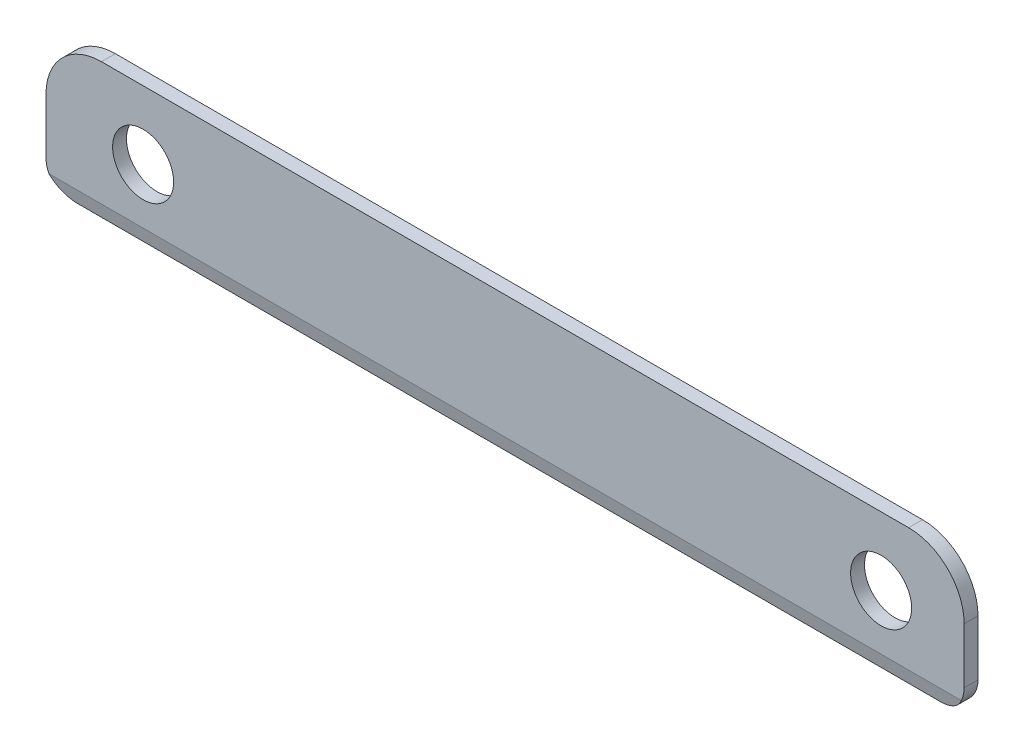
ISO-10303-21;
HEADER;
FILE_DESCRIPTION(('STEP AP214'),'2;1');
FILE_NAME('part.step','',(''),(''),'','','');
FILE_SCHEMA(('AUTOMOTIVE_DESIGN { 1 0 10303 214 1 1 1 1 }'));
ENDSEC;
DATA;
#1=APPLICATION_CONTEXT('core data for automotive mechanical design processes');
#2=APPLICATION_PROTOCOL_DEFINITION('international standard','automotive_design',2000,#1);
#3=PRODUCT_CONTEXT('',#1,'mechanical');
#4=PRODUCT('Part','Part','',(#3));
#5=PRODUCT_RELATED_PRODUCT_CATEGORY('part','',(#4));
#6=PRODUCT_DEFINITION_FORMATION('','',#4);
#7=PRODUCT_DEFINITION_CONTEXT('part definition',#1,'design');
#8=PRODUCT_DEFINITION('design','',#6,#7);
#9=PRODUCT_DEFINITION_SHAPE('','',#8);
#10=(LENGTH_UNIT() NAMED_UNIT(*) SI_UNIT(.MILLI.,.METRE.));
#11=(NAMED_UNIT(*) PLANE_ANGLE_UNIT() SI_UNIT($,.RADIAN.));
#12=(NAMED_UNIT(*) SI_UNIT($,.STERADIAN.) SOLID_ANGLE_UNIT());
#13=UNCERTAINTY_MEASURE_WITH_UNIT(LENGTH_MEASURE(1.E-05),#10,'distance_accuracy_value','');
#14=(GEOMETRIC_REPRESENTATION_CONTEXT(3) GLOBAL_UNCERTAINTY_ASSIGNED_CONTEXT((#13)) GLOBAL_UNIT_ASSIGNED_CONTEXT((#10,
#11,#12)) REPRESENTATION_CONTEXT('',''));
#15=CARTESIAN_POINT('',(0.,0.,0.));
#16=DIRECTION('',(0.,0.,1.));
#17=DIRECTION('',(1.,0.,0.));
#18=AXIS2_PLACEMENT_3D('',#15,#16,#17);
#19=CARTESIAN_POINT('',(145.845208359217,4.31677215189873,5.));
#20=DIRECTION('',(0.,0.,1.));
#21=DIRECTION('',(1.,0.,0.));
#22=AXIS2_PLACEMENT_3D('',#19,#20,#21);
#23=PLANE('',#22);
#24=DIRECTION('',(-1.,0.,0.));
#25=VECTOR('',#24,1.);
#26=CARTESIAN_POINT('',(165.845208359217,-20.1091288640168,4.99999999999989));
#27=LINE('',#26,#25);
#28=CARTESIAN_POINT('',(164.812448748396,-20.1091288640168,4.99999999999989));
#29=VERTEX_POINT('',#28);
#30=CARTESIAN_POINT('',(-164.04086295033,-20.1091288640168,4.99999999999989));
#31=VERTEX_POINT('',#30);
#32=EDGE_CURVE('E197',#29,#31,#27,.T.);
#33=ORIENTED_EDGE('',*,*,#32,.F.);
#34=CARTESIAN_POINT('',(155.845208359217,-15.6832278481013,5.));
#35=DIRECTION('',(0.,0.,1.));
#36=DIRECTION('',(-1.,0.,0.));
#37=AXIS2_PLACEMENT_3D('',#34,#35,#36);
#38=CIRCLE('',#37,10.);
#39=CARTESIAN_POINT('',(165.845208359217,-15.6832278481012,5.));
#40=VERTEX_POINT('',#39);
#41=EDGE_CURVE('E136',#29,#40,#38,.T.);
#42=ORIENTED_EDGE('',*,*,#41,.T.);
#43=DIRECTION('',(0.,1.,0.));
#44=VECTOR('',#43,1.);
#45=CARTESIAN_POINT('',(165.845208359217,-15.6832278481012,5.));
#46=LINE('',#45,#44);
#47=CARTESIAN_POINT('',(165.845208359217,4.31677215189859,5.));
#48=VERTEX_POINT('',#47);
#49=EDGE_CURVE('E56',#40,#48,#46,.T.);
#50=ORIENTED_EDGE('',*,*,#49,.T.);
#51=CARTESIAN_POINT('',(145.845208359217,4.31677215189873,5.));
#52=DIRECTION('',(0.,0.,1.));
#53=DIRECTION('',(1.,0.,0.));
#54=AXIS2_PLACEMENT_3D('',#51,#52,#53);
#55=CIRCLE('',#54,20.);
#56=CARTESIAN_POINT('',(145.845208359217,24.3167721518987,5.));
#57=VERTEX_POINT('',#56);
#58=EDGE_CURVE('E160',#48,#57,#55,.T.);
#59=ORIENTED_EDGE('',*,*,#58,.T.);
#60=DIRECTION('',(-1.,0.,0.));
#61=VECTOR('',#60,1.);
#62=CARTESIAN_POINT('',(-145.073622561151,24.3167721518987,5.));
#63=LINE('',#62,#61);
#64=CARTESIAN_POINT('',(-145.073622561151,24.3167721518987,5.));
#65=VERTEX_POINT('',#64);
#66=EDGE_CURVE('E98',#57,#65,#63,.T.);
#67=ORIENTED_EDGE('',*,*,#66,.T.);
#68=CARTESIAN_POINT('',(-145.073622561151,4.31677215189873,5.));
#69=DIRECTION('',(0.,0.,1.));
#70=DIRECTION('',(-1.,0.,0.));
#71=AXIS2_PLACEMENT_3D('',#68,#69,#70);
#72=CIRCLE('',#71,20.);
#73=CARTESIAN_POINT('',(-165.073622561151,4.31677215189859,5.));
#74=VERTEX_POINT('',#73);
#75=EDGE_CURVE('E116',#65,#74,#72,.T.);
#76=ORIENTED_EDGE('',*,*,#75,.T.);
#77=DIRECTION('',(0.,-1.,0.));
#78=VECTOR('',#77,1.);
#79=CARTESIAN_POINT('',(-165.073622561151,-15.6832278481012,5.));
#80=LINE('',#79,#78);
#81=CARTESIAN_POINT('',(-165.073622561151,-15.6832278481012,5.));
#82=VERTEX_POINT('',#81);
#83=EDGE_CURVE('E108',#74,#82,#80,.T.);
#84=ORIENTED_EDGE('',*,*,#83,.T.);
#85=CARTESIAN_POINT('',(-155.073622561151,-15.6832278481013,5.));
#86=DIRECTION('',(0.,0.,1.));
#87=DIRECTION('',(1.,0.,0.));
#88=AXIS2_PLACEMENT_3D('',#85,#86,#87);
#89=CIRCLE('',#88,10.);
#90=EDGE_CURVE('E114',#82,#31,#89,.T.);
#91=ORIENTED_EDGE('',*,*,#90,.T.);
#92=EDGE_LOOP('',(#33,#42,#50,#59,#67,#76,#84,#91));
#93=FACE_BOUND('',#92,.T.);
#94=CARTESIAN_POINT('',(-130.073622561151,-0.263085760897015,5.));
#95=DIRECTION('',(0.,0.,1.));
#96=DIRECTION('',(1.,0.,0.));
#97=AXIS2_PLACEMENT_3D('',#94,#95,#96);
#98=CIRCLE('',#97,11.);
#99=CARTESIAN_POINT('',(-119.073622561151,-0.263085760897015,5.));
#100=VERTEX_POINT('',#99);
#101=EDGE_CURVE('E147',#100,#100,#98,.T.);
#102=ORIENTED_EDGE('',*,*,#101,.F.);
#103=EDGE_LOOP('',(#102));
#104=FACE_BOUND('',#103,.T.);
#105=CARTESIAN_POINT('',(135.926377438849,-0.263085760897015,5.));
#106=DIRECTION('',(0.,0.,1.));
#107=DIRECTION('',(1.,0.,0.));
#108=AXIS2_PLACEMENT_3D('',#105,#106,#107);
#109=CIRCLE('',#108,11.);
#110=CARTESIAN_POINT('',(146.926377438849,-0.263085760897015,5.));
#111=VERTEX_POINT('',#110);
#112=EDGE_CURVE('E188',#111,#111,#109,.T.);
#113=ORIENTED_EDGE('',*,*,#112,.F.);
#114=EDGE_LOOP('',(#113));
#115=FACE_BOUND('',#114,.T.);
#116=ADVANCED_FACE('F33',(#93,#104,#115),#23,.T.);
#117=CARTESIAN_POINT('',(145.845208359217,4.31677215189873,0.));
#118=DIRECTION('',(0.,0.,1.));
#119=DIRECTION('',(1.,0.,0.));
#120=AXIS2_PLACEMENT_3D('',#117,#118,#119);
#121=PLANE('',#120);
#122=CARTESIAN_POINT('',(145.845208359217,4.31677215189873,0.));
#123=DIRECTION('',(0.,0.,1.));
#124=DIRECTION('',(1.,0.,0.));
#125=AXIS2_PLACEMENT_3D('',#122,#123,#124);
#126=CIRCLE('',#125,20.);
#127=CARTESIAN_POINT('',(165.845208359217,4.31677215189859,0.));
#128=VERTEX_POINT('',#127);
#129=CARTESIAN_POINT('',(145.845208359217,24.3167721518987,0.));
#130=VERTEX_POINT('',#129);
#131=EDGE_CURVE('E143',#128,#130,#126,.T.);
#132=ORIENTED_EDGE('',*,*,#131,.F.);
#133=DIRECTION('',(0.,1.,0.));
#134=VECTOR('',#133,1.);
#135=CARTESIAN_POINT('',(165.845208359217,-15.6832278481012,0.));
#136=LINE('',#135,#134);
#137=CARTESIAN_POINT('',(165.845208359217,-15.6832278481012,0.));
#138=VERTEX_POINT('',#137);
#139=EDGE_CURVE('E89',#138,#128,#136,.T.);
#140=ORIENTED_EDGE('',*,*,#139,.F.);
#141=CARTESIAN_POINT('',(155.845208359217,-15.6832278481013,0.));
#142=DIRECTION('',(0.,0.,1.));
#143=DIRECTION('',(-1.,0.,0.));
#144=AXIS2_PLACEMENT_3D('',#141,#142,#143);
#145=CIRCLE('',#144,10.);
#146=CARTESIAN_POINT('',(155.845208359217,-25.6832278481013,0.));
#147=VERTEX_POINT('',#146);
#148=EDGE_CURVE('E157',#147,#138,#145,.T.);
#149=ORIENTED_EDGE('',*,*,#148,.F.);
#150=DIRECTION('',(1.,0.,0.));
#151=VECTOR('',#150,1.);
#152=CARTESIAN_POINT('',(-155.073622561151,-25.6832278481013,0.));
#153=LINE('',#152,#151);
#154=CARTESIAN_POINT('',(-155.073622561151,-25.6832278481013,0.));
#155=VERTEX_POINT('',#154);
#156=EDGE_CURVE('E154',#155,#147,#153,.T.);
#157=ORIENTED_EDGE('',*,*,#156,.F.);
#158=CARTESIAN_POINT('',(-155.073622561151,-15.6832278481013,0.));
#159=DIRECTION('',(0.,0.,1.));
#160=DIRECTION('',(1.,0.,0.));
#161=AXIS2_PLACEMENT_3D('',#158,#159,#160);
#162=CIRCLE('',#161,10.);
#163=CARTESIAN_POINT('',(-165.073622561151,-15.6832278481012,0.));
#164=VERTEX_POINT('',#163);
#165=EDGE_CURVE('E152',#164,#155,#162,.T.);
#166=ORIENTED_EDGE('',*,*,#165,.F.);
#167=DIRECTION('',(0.,-1.,0.));
#168=VECTOR('',#167,1.);
#169=CARTESIAN_POINT('',(-165.073622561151,-15.6832278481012,0.));
#170=LINE('',#169,#168);
#171=CARTESIAN_POINT('',(-165.073622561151,4.31677215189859,0.));
#172=VERTEX_POINT('',#171);
#173=EDGE_CURVE('E125',#172,#164,#170,.T.);
#174=ORIENTED_EDGE('',*,*,#173,.F.);
#175=CARTESIAN_POINT('',(-145.073622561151,4.31677215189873,0.));
#176=DIRECTION('',(0.,0.,1.));
#177=DIRECTION('',(-1.,0.,0.));
#178=AXIS2_PLACEMENT_3D('',#175,#176,#177);
#179=CIRCLE('',#178,20.);
#180=CARTESIAN_POINT('',(-145.073622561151,24.3167721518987,0.));
#181=VERTEX_POINT('',#180);
#182=EDGE_CURVE('E149',#181,#172,#179,.T.);
#183=ORIENTED_EDGE('',*,*,#182,.F.);
#184=DIRECTION('',(-1.,0.,0.));
#185=VECTOR('',#184,1.);
#186=CARTESIAN_POINT('',(-145.073622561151,24.3167721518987,0.));
#187=LINE('',#186,#185);
#188=EDGE_CURVE('E146',#130,#181,#187,.T.);
#189=ORIENTED_EDGE('',*,*,#188,.F.);
#190=EDGE_LOOP('',(#132,#140,#149,#157,#166,#174,#183,#189));
#191=FACE_BOUND('',#190,.T.);
#192=CARTESIAN_POINT('',(-130.073622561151,-0.263085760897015,0.));
#193=DIRECTION('',(0.,0.,1.));
#194=DIRECTION('',(1.,0.,0.));
#195=AXIS2_PLACEMENT_3D('',#192,#193,#194);
#196=CIRCLE('',#195,11.);
#197=CARTESIAN_POINT('',(-119.073622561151,-0.263085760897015,0.));
#198=VERTEX_POINT('',#197);
#199=EDGE_CURVE('E185',#198,#198,#196,.T.);
#200=ORIENTED_EDGE('',*,*,#199,.T.);
#201=EDGE_LOOP('',(#200));
#202=FACE_BOUND('',#201,.T.);
#203=CARTESIAN_POINT('',(135.926377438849,-0.263085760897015,0.));
#204=DIRECTION('',(0.,0.,1.));
#205=DIRECTION('',(1.,0.,0.));
#206=AXIS2_PLACEMENT_3D('',#203,#204,#205);
#207=CIRCLE('',#206,11.);
#208=CARTESIAN_POINT('',(146.926377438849,-0.263085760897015,0.));
#209=VERTEX_POINT('',#208);
#210=EDGE_CURVE('E191',#209,#209,#207,.T.);
#211=ORIENTED_EDGE('',*,*,#210,.T.);
#212=EDGE_LOOP('',(#211));
#213=FACE_BOUND('',#212,.T.);
#214=ADVANCED_FACE('F176',(#191,#202,#213),#121,.F.);
#215=CARTESIAN_POINT('',(145.845208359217,4.31677215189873,5.));
#216=DIRECTION('',(0.,0.,-1.));
#217=DIRECTION('',(-1.,0.,0.));
#218=AXIS2_PLACEMENT_3D('',#215,#216,#217);
#219=CYLINDRICAL_SURFACE('',#218,20.);
#220=ORIENTED_EDGE('',*,*,#131,.T.);
#221=DIRECTION('',(0.,0.,-1.));
#222=VECTOR('',#221,1.);
#223=CARTESIAN_POINT('',(145.845208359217,24.3167721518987,5.));
#224=LINE('',#223,#222);
#225=EDGE_CURVE('E41',#57,#130,#224,.T.);
#226=ORIENTED_EDGE('',*,*,#225,.F.);
#227=ORIENTED_EDGE('',*,*,#58,.F.);
#228=DIRECTION('',(0.,0.,-1.));
#229=VECTOR('',#228,1.);
#230=CARTESIAN_POINT('',(165.845208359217,4.31677215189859,5.));
#231=LINE('',#230,#229);
#232=EDGE_CURVE('E142',#48,#128,#231,.T.);
#233=ORIENTED_EDGE('',*,*,#232,.T.);
#234=EDGE_LOOP('',(#220,#226,#227,#233));
#235=FACE_BOUND('',#234,.T.);
#236=ADVANCED_FACE('F35',(#235),#219,.T.);
#237=CARTESIAN_POINT('',(-145.073622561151,24.3167721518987,5.));
#238=DIRECTION('',(0.,-1.,0.));
#239=DIRECTION('',(0.,0.,-1.));
#240=AXIS2_PLACEMENT_3D('',#237,#238,#239);
#241=PLANE('',#240);
#242=ORIENTED_EDGE('',*,*,#188,.T.);
#243=DIRECTION('',(0.,0.,-1.));
#244=VECTOR('',#243,1.);
#245=CARTESIAN_POINT('',(-145.073622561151,24.3167721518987,5.));
#246=LINE('',#245,#244);
#247=EDGE_CURVE('E168',#65,#181,#246,.T.);
#248=ORIENTED_EDGE('',*,*,#247,.F.);
#249=ORIENTED_EDGE('',*,*,#66,.F.);
#250=ORIENTED_EDGE('',*,*,#225,.T.);
#251=EDGE_LOOP('',(#242,#248,#249,#250));
#252=FACE_BOUND('',#251,.T.);
#253=ADVANCED_FACE('F171',(#252),#241,.F.);
#254=CARTESIAN_POINT('',(-145.073622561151,4.31677215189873,5.));
#255=DIRECTION('',(0.,0.,-1.));
#256=DIRECTION('',(-1.,0.,0.));
#257=AXIS2_PLACEMENT_3D('',#254,#255,#256);
#258=CYLINDRICAL_SURFACE('',#257,20.);
#259=ORIENTED_EDGE('',*,*,#182,.T.);
#260=DIRECTION('',(0.,0.,-1.));
#261=VECTOR('',#260,1.);
#262=CARTESIAN_POINT('',(-165.073622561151,4.31677215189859,5.));
#263=LINE('',#262,#261);
#264=EDGE_CURVE('E129',#74,#172,#263,.T.);
#265=ORIENTED_EDGE('',*,*,#264,.F.);
#266=ORIENTED_EDGE('',*,*,#75,.F.);
#267=ORIENTED_EDGE('',*,*,#247,.T.);
#268=EDGE_LOOP('',(#259,#265,#266,#267));
#269=FACE_BOUND('',#268,.T.);
#270=ADVANCED_FACE('F181',(#269),#258,.T.);
#271=CARTESIAN_POINT('',(-165.073622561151,-15.6832278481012,5.));
#272=DIRECTION('',(1.,0.,0.));
#273=DIRECTION('',(0.,0.,-1.));
#274=AXIS2_PLACEMENT_3D('',#271,#272,#273);
#275=PLANE('',#274);
#276=ORIENTED_EDGE('',*,*,#173,.T.);
#277=DIRECTION('',(0.,0.,-1.));
#278=VECTOR('',#277,1.);
#279=CARTESIAN_POINT('',(-165.073622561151,-15.6832278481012,5.));
#280=LINE('',#279,#278);
#281=EDGE_CURVE('E122',#82,#164,#280,.T.);
#282=ORIENTED_EDGE('',*,*,#281,.F.);
#283=ORIENTED_EDGE('',*,*,#83,.F.);
#284=ORIENTED_EDGE('',*,*,#264,.T.);
#285=EDGE_LOOP('',(#276,#282,#283,#284));
#286=FACE_BOUND('',#285,.T.);
#287=ADVANCED_FACE('F123',(#286),#275,.F.);
#288=CARTESIAN_POINT('',(-155.073622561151,-15.6832278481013,5.));
#289=DIRECTION('',(0.,0.,-1.));
#290=DIRECTION('',(-1.,0.,0.));
#291=AXIS2_PLACEMENT_3D('',#288,#289,#290);
#292=CYLINDRICAL_SURFACE('',#291,10.);
#293=DIRECTION('',(0.,0.,-1.));
#294=VECTOR('',#293,1.);
#295=CARTESIAN_POINT('',(-155.073622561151,-25.6832278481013,5.));
#296=LINE('',#295,#294);
#297=CARTESIAN_POINT('',(-155.073622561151,-25.6832278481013,3.57804998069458));
#298=VERTEX_POINT('',#297);
#299=EDGE_CURVE('E130',#298,#155,#296,.T.);
#300=ORIENTED_EDGE('',*,*,#299,.F.);
#301=CARTESIAN_POINT('',(-155.073622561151,-15.6832278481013,6.12904525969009));
#302=DIRECTION('',(0.,0.24718345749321,-0.968968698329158));
#303=DIRECTION('',(0.,-0.968968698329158,-0.24718345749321));
#304=AXIS2_PLACEMENT_3D('',#301,#302,#303);
#305=ELLIPSE('',#304,10.3202508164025,10.);
#306=EDGE_CURVE('E135',#298,#31,#305,.T.);
#307=ORIENTED_EDGE('',*,*,#306,.T.);
#308=ORIENTED_EDGE('',*,*,#90,.F.);
#309=ORIENTED_EDGE('',*,*,#281,.T.);
#310=ORIENTED_EDGE('',*,*,#165,.T.);
#311=EDGE_LOOP('',(#300,#307,#308,#309,#310));
#312=FACE_BOUND('',#311,.T.);
#313=ADVANCED_FACE('F134',(#312),#292,.T.);
#314=CARTESIAN_POINT('',(-155.073622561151,-25.6832278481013,5.));
#315=DIRECTION('',(0.,1.,0.));
#316=DIRECTION('',(0.,0.,1.));
#317=AXIS2_PLACEMENT_3D('',#314,#315,#316);
#318=PLANE('',#317);
#319=DIRECTION('',(0.,0.,-1.));
#320=VECTOR('',#319,1.);
#321=CARTESIAN_POINT('',(155.845208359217,-25.6832278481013,5.));
#322=LINE('',#321,#320);
#323=CARTESIAN_POINT('',(155.845208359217,-25.6832278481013,3.57804998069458));
#324=VERTEX_POINT('',#323);
#325=EDGE_CURVE('E164',#324,#147,#322,.T.);
#326=ORIENTED_EDGE('',*,*,#325,.F.);
#327=DIRECTION('',(-1.,0.,0.));
#328=VECTOR('',#327,1.);
#329=CARTESIAN_POINT('',(165.845208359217,-25.6832278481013,3.57804998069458));
#330=LINE('',#329,#328);
#331=EDGE_CURVE('E48',#324,#298,#330,.T.);
#332=ORIENTED_EDGE('',*,*,#331,.T.);
#333=ORIENTED_EDGE('',*,*,#299,.T.);
#334=ORIENTED_EDGE('',*,*,#156,.T.);
#335=EDGE_LOOP('',(#326,#332,#333,#334));
#336=FACE_BOUND('',#335,.T.);
#337=ADVANCED_FACE('F202',(#336),#318,.F.);
#338=CARTESIAN_POINT('',(155.845208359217,-15.6832278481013,5.));
#339=DIRECTION('',(0.,0.,-1.));
#340=DIRECTION('',(-1.,0.,0.));
#341=AXIS2_PLACEMENT_3D('',#338,#339,#340);
#342=CYLINDRICAL_SURFACE('',#341,10.);
#343=ORIENTED_EDGE('',*,*,#41,.F.);
#344=CARTESIAN_POINT('',(155.845208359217,-15.6832278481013,6.12904525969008));
#345=DIRECTION('',(0.,0.24718345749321,-0.968968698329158));
#346=DIRECTION('',(0.,-0.968968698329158,-0.24718345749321));
#347=AXIS2_PLACEMENT_3D('',#344,#345,#346);
#348=ELLIPSE('',#347,10.3202508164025,10.);
#349=EDGE_CURVE('E11',#29,#324,#348,.T.);
#350=ORIENTED_EDGE('',*,*,#349,.T.);
#351=ORIENTED_EDGE('',*,*,#325,.T.);
#352=ORIENTED_EDGE('',*,*,#148,.T.);
#353=DIRECTION('',(0.,0.,-1.));
#354=VECTOR('',#353,1.);
#355=CARTESIAN_POINT('',(165.845208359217,-15.6832278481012,5.));
#356=LINE('',#355,#354);
#357=EDGE_CURVE('E162',#40,#138,#356,.T.);
#358=ORIENTED_EDGE('',*,*,#357,.F.);
#359=EDGE_LOOP('',(#343,#350,#351,#352,#358));
#360=FACE_BOUND('',#359,.T.);
#361=ADVANCED_FACE('F207',(#360),#342,.T.);
#362=CARTESIAN_POINT('',(165.845208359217,-15.6832278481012,5.));
#363=DIRECTION('',(-1.,0.,0.));
#364=DIRECTION('',(0.,0.,1.));
#365=AXIS2_PLACEMENT_3D('',#362,#363,#364);
#366=PLANE('',#365);
#367=ORIENTED_EDGE('',*,*,#139,.T.);
#368=ORIENTED_EDGE('',*,*,#232,.F.);
#369=ORIENTED_EDGE('',*,*,#49,.F.);
#370=ORIENTED_EDGE('',*,*,#357,.T.);
#371=EDGE_LOOP('',(#367,#368,#369,#370));
#372=FACE_BOUND('',#371,.T.);
#373=ADVANCED_FACE('F208',(#372),#366,.F.);
#374=CARTESIAN_POINT('',(-130.073622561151,-0.263085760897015,5.));
#375=DIRECTION('',(0.,0.,-1.));
#376=DIRECTION('',(-1.,0.,0.));
#377=AXIS2_PLACEMENT_3D('',#374,#375,#376);
#378=CYLINDRICAL_SURFACE('',#377,11.);
#379=ORIENTED_EDGE('',*,*,#101,.T.);
#380=EDGE_LOOP('',(#379));
#381=FACE_BOUND('',#380,.T.);
#382=ORIENTED_EDGE('',*,*,#199,.F.);
#383=EDGE_LOOP('',(#382));
#384=FACE_BOUND('',#383,.T.);
#385=ADVANCED_FACE('F210',(#381,#384),#378,.F.);
#386=CARTESIAN_POINT('',(135.926377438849,-0.263085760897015,5.));
#387=DIRECTION('',(0.,0.,-1.));
#388=DIRECTION('',(-1.,0.,0.));
#389=AXIS2_PLACEMENT_3D('',#386,#387,#388);
#390=CYLINDRICAL_SURFACE('',#389,11.);
#391=ORIENTED_EDGE('',*,*,#112,.T.);
#392=EDGE_LOOP('',(#391));
#393=FACE_BOUND('',#392,.T.);
#394=ORIENTED_EDGE('',*,*,#210,.F.);
#395=EDGE_LOOP('',(#394));
#396=FACE_BOUND('',#395,.T.);
#397=ADVANCED_FACE('F216',(#393,#396),#390,.F.);
#398=CARTESIAN_POINT('',(165.845208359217,-20.1091288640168,4.99999999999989));
#399=DIRECTION('',(0.,0.24718345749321,-0.968968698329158));
#400=DIRECTION('',(0.,0.968968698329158,0.24718345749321));
#401=AXIS2_PLACEMENT_3D('',#398,#399,#400);
#402=PLANE('',#401);
#403=ORIENTED_EDGE('',*,*,#331,.F.);
#404=ORIENTED_EDGE('',*,*,#349,.F.);
#405=ORIENTED_EDGE('',*,*,#32,.T.);
#406=ORIENTED_EDGE('',*,*,#306,.F.);
#407=EDGE_LOOP('',(#403,#404,#405,#406));
#408=FACE_BOUND('',#407,.T.);
#409=ADVANCED_FACE('F229',(#408),#402,.F.);
#410=CLOSED_SHELL('',(#116,#214,#236,#253,#270,#287,#313,#337,#361,#373,#385,#397,#409));
#411=MANIFOLD_SOLID_BREP('B2',#410);
#412=ADVANCED_BREP_SHAPE_REPRESENTATION('',(#18,#411),#14);
#413=SHAPE_DEFINITION_REPRESENTATION(#9,#412);
ENDSEC;
END-ISO-10303-21;
